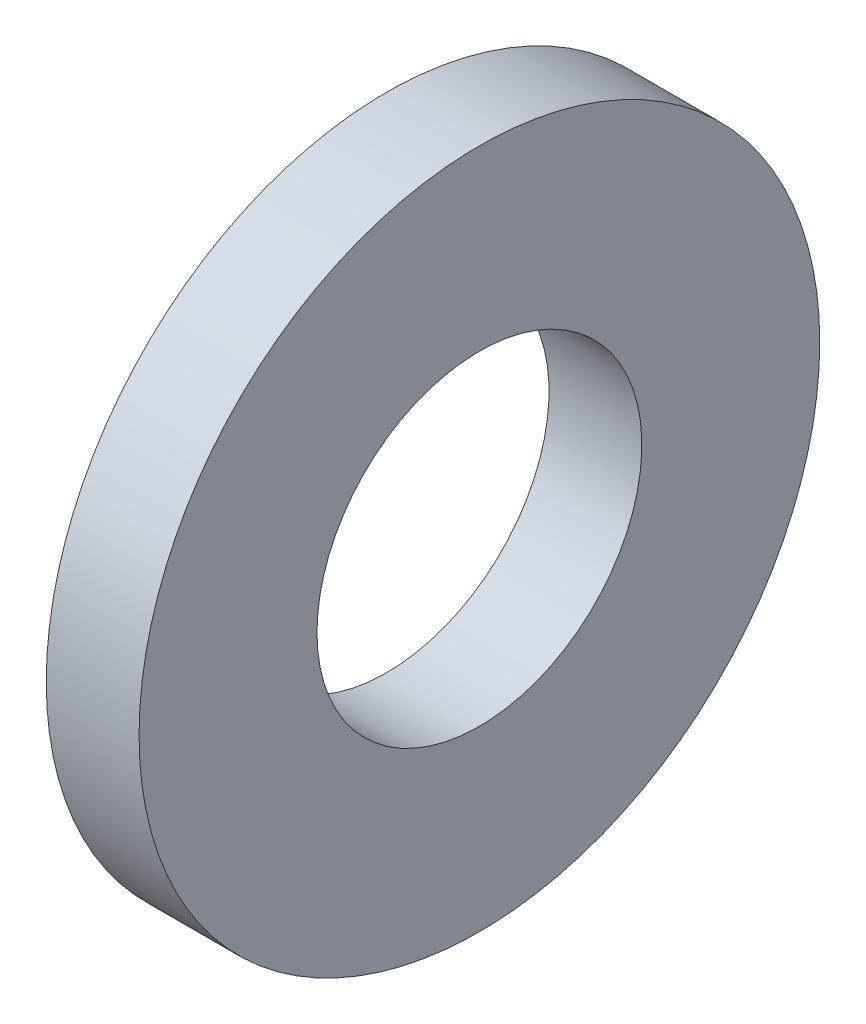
ISO-10303-21;
HEADER;
FILE_DESCRIPTION(('STEP AP214'),'2;1');
FILE_NAME('part.step','',(''),(''),'','','');
FILE_SCHEMA(('AUTOMOTIVE_DESIGN { 1 0 10303 214 1 1 1 1 }'));
ENDSEC;
DATA;
#1=APPLICATION_CONTEXT('core data for automotive mechanical design processes');
#2=APPLICATION_PROTOCOL_DEFINITION('international standard','automotive_design',2000,#1);
#3=PRODUCT_CONTEXT('',#1,'mechanical');
#4=PRODUCT('Part','Part','',(#3));
#5=PRODUCT_RELATED_PRODUCT_CATEGORY('part','',(#4));
#6=PRODUCT_DEFINITION_FORMATION('','',#4);
#7=PRODUCT_DEFINITION_CONTEXT('part definition',#1,'design');
#8=PRODUCT_DEFINITION('design','',#6,#7);
#9=PRODUCT_DEFINITION_SHAPE('','',#8);
#10=(LENGTH_UNIT() NAMED_UNIT(*) SI_UNIT(.MILLI.,.METRE.));
#11=(NAMED_UNIT(*) PLANE_ANGLE_UNIT() SI_UNIT($,.RADIAN.));
#12=(NAMED_UNIT(*) SI_UNIT($,.STERADIAN.) SOLID_ANGLE_UNIT());
#13=UNCERTAINTY_MEASURE_WITH_UNIT(LENGTH_MEASURE(1.E-05),#10,'distance_accuracy_value','');
#14=(GEOMETRIC_REPRESENTATION_CONTEXT(3) GLOBAL_UNCERTAINTY_ASSIGNED_CONTEXT((#13)) GLOBAL_UNIT_ASSIGNED_CONTEXT((#10,
#11,#12)) REPRESENTATION_CONTEXT('',''));
#15=CARTESIAN_POINT('',(0.,0.,0.));
#16=DIRECTION('',(0.,0.,1.));
#17=DIRECTION('',(1.,0.,0.));
#18=AXIS2_PLACEMENT_3D('',#15,#16,#17);
#19=CARTESIAN_POINT('',(0.,0.,-5.25));
#20=DIRECTION('',(1.,0.,0.));
#21=DIRECTION('',(0.,0.,-1.));
#22=AXIS2_PLACEMENT_3D('',#19,#20,#21);
#23=PLANE('',#22);
#24=CARTESIAN_POINT('',(0.,0.,0.));
#25=DIRECTION('',(-1.,0.,0.));
#26=DIRECTION('',(0.,0.,1.));
#27=AXIS2_PLACEMENT_3D('',#24,#25,#26);
#28=CIRCLE('',#27,5.25);
#29=CARTESIAN_POINT('',(0.,0.,5.25));
#30=VERTEX_POINT('',#29);
#31=EDGE_CURVE('E44',#30,#30,#28,.T.);
#32=ORIENTED_EDGE('',*,*,#31,.F.);
#33=EDGE_LOOP('',(#32));
#34=FACE_BOUND('',#33,.T.);
#35=CARTESIAN_POINT('',(0.,0.,0.));
#36=DIRECTION('',(-1.,0.,0.));
#37=DIRECTION('',(0.,0.,1.));
#38=AXIS2_PLACEMENT_3D('',#35,#36,#37);
#39=CIRCLE('',#38,11.);
#40=CARTESIAN_POINT('',(0.,0.,11.));
#41=VERTEX_POINT('',#40);
#42=EDGE_CURVE('E10',#41,#41,#39,.T.);
#43=ORIENTED_EDGE('',*,*,#42,.T.);
#44=EDGE_LOOP('',(#43));
#45=FACE_BOUND('',#44,.T.);
#46=ADVANCED_FACE('F30',(#34,#45),#23,.F.);
#47=CARTESIAN_POINT('',(0.,0.,0.));
#48=DIRECTION('',(-1.,0.,0.));
#49=DIRECTION('',(0.,0.,1.));
#50=AXIS2_PLACEMENT_3D('',#47,#48,#49);
#51=CYLINDRICAL_SURFACE('',#50,11.);
#52=ORIENTED_EDGE('',*,*,#42,.F.);
#53=EDGE_LOOP('',(#52));
#54=FACE_BOUND('',#53,.T.);
#55=CARTESIAN_POINT('',(3.00000000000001,0.,0.));
#56=DIRECTION('',(-1.,0.,0.));
#57=DIRECTION('',(0.,0.,1.));
#58=AXIS2_PLACEMENT_3D('',#55,#56,#57);
#59=CIRCLE('',#58,11.);
#60=CARTESIAN_POINT('',(3.00000000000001,0.,11.));
#61=VERTEX_POINT('',#60);
#62=EDGE_CURVE('E36',#61,#61,#59,.T.);
#63=ORIENTED_EDGE('',*,*,#62,.T.);
#64=EDGE_LOOP('',(#63));
#65=FACE_BOUND('',#64,.T.);
#66=ADVANCED_FACE('F53',(#54,#65),#51,.T.);
#67=CARTESIAN_POINT('',(3.00000000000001,0.,-5.25));
#68=DIRECTION('',(-1.,0.,0.));
#69=DIRECTION('',(0.,0.,1.));
#70=AXIS2_PLACEMENT_3D('',#67,#68,#69);
#71=PLANE('',#70);
#72=ORIENTED_EDGE('',*,*,#62,.F.);
#73=EDGE_LOOP('',(#72));
#74=FACE_BOUND('',#73,.T.);
#75=CARTESIAN_POINT('',(3.00000000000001,0.,0.));
#76=DIRECTION('',(-1.,0.,0.));
#77=DIRECTION('',(0.,0.,1.));
#78=AXIS2_PLACEMENT_3D('',#75,#76,#77);
#79=CIRCLE('',#78,5.25);
#80=CARTESIAN_POINT('',(3.00000000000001,0.,5.25));
#81=VERTEX_POINT('',#80);
#82=EDGE_CURVE('E40',#81,#81,#79,.T.);
#83=ORIENTED_EDGE('',*,*,#82,.T.);
#84=EDGE_LOOP('',(#83));
#85=FACE_BOUND('',#84,.T.);
#86=ADVANCED_FACE('F57',(#74,#85),#71,.F.);
#87=CARTESIAN_POINT('',(0.,0.,0.));
#88=DIRECTION('',(-1.,0.,0.));
#89=DIRECTION('',(0.,0.,1.));
#90=AXIS2_PLACEMENT_3D('',#87,#88,#89);
#91=CYLINDRICAL_SURFACE('',#90,5.25);
#92=ORIENTED_EDGE('',*,*,#82,.F.);
#93=EDGE_LOOP('',(#92));
#94=FACE_BOUND('',#93,.T.);
#95=ORIENTED_EDGE('',*,*,#31,.T.);
#96=EDGE_LOOP('',(#95));
#97=FACE_BOUND('',#96,.T.);
#98=ADVANCED_FACE('F50',(#94,#97),#91,.F.);
#99=CLOSED_SHELL('',(#46,#66,#86,#98));
#100=MANIFOLD_SOLID_BREP('B2',#99);
#101=ADVANCED_BREP_SHAPE_REPRESENTATION('',(#18,#100),#14);
#102=SHAPE_DEFINITION_REPRESENTATION(#9,#101);
ENDSEC;
END-ISO-10303-21;
